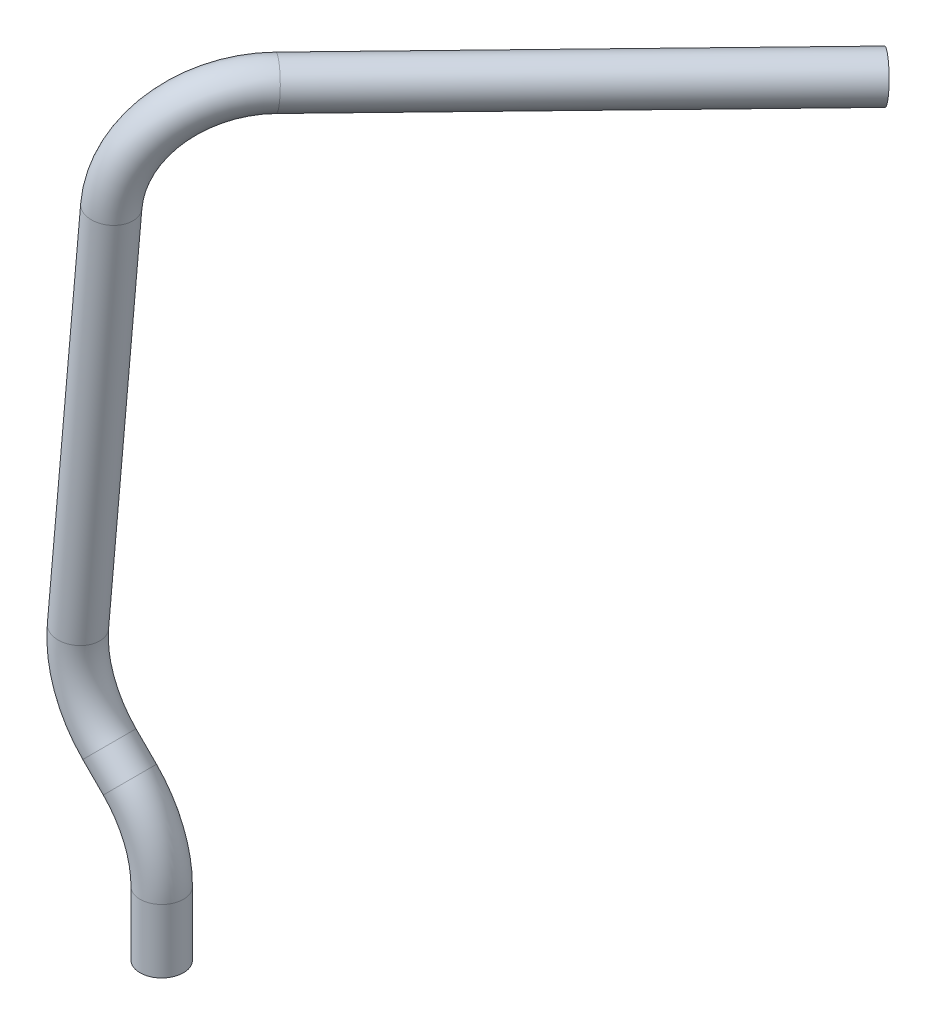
ISO-10303-21;
HEADER;
FILE_DESCRIPTION(('STEP AP214'),'2;1');
FILE_NAME('part.step','',(''),(''),'','','');
FILE_SCHEMA(('AUTOMOTIVE_DESIGN { 1 0 10303 214 1 1 1 1 }'));
ENDSEC;
DATA;
#1=APPLICATION_CONTEXT('core data for automotive mechanical design processes');
#2=APPLICATION_PROTOCOL_DEFINITION('international standard','automotive_design',2000,#1);
#3=PRODUCT_CONTEXT('',#1,'mechanical');
#4=PRODUCT('Part','Part','',(#3));
#5=PRODUCT_RELATED_PRODUCT_CATEGORY('part','',(#4));
#6=PRODUCT_DEFINITION_FORMATION('','',#4);
#7=PRODUCT_DEFINITION_CONTEXT('part definition',#1,'design');
#8=PRODUCT_DEFINITION('design','',#6,#7);
#9=PRODUCT_DEFINITION_SHAPE('','',#8);
#10=(LENGTH_UNIT() NAMED_UNIT(*) SI_UNIT(.MILLI.,.METRE.));
#11=(NAMED_UNIT(*) PLANE_ANGLE_UNIT() SI_UNIT($,.RADIAN.));
#12=(NAMED_UNIT(*) SI_UNIT($,.STERADIAN.) SOLID_ANGLE_UNIT());
#13=UNCERTAINTY_MEASURE_WITH_UNIT(LENGTH_MEASURE(1.E-05),#10,'distance_accuracy_value','');
#14=(GEOMETRIC_REPRESENTATION_CONTEXT(3) GLOBAL_UNCERTAINTY_ASSIGNED_CONTEXT((#13)) GLOBAL_UNIT_ASSIGNED_CONTEXT((#10,
#11,#12)) REPRESENTATION_CONTEXT('',''));
#15=CARTESIAN_POINT('',(0.,0.,0.));
#16=DIRECTION('',(0.,0.,1.));
#17=DIRECTION('',(1.,0.,0.));
#18=AXIS2_PLACEMENT_3D('',#15,#16,#17);
#19=CARTESIAN_POINT('',(5.992077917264,159.960109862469,-19.033076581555));
#20=DIRECTION('',(0.615661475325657,-0.0723791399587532,-0.784679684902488));
#21=DIRECTION('',(-0.786743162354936,0.,-0.617280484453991));
#22=AXIS2_PLACEMENT_3D('',#19,#20,#21);
#23=CYLINDRICAL_SURFACE('',#22,4.7625);
#24=CARTESIAN_POINT('',(5.992077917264,159.960109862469,-19.033076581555));
#25=DIRECTION('',(0.615661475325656,-0.0723791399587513,-0.784679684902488));
#26=DIRECTION('',(0.561849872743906,0.738521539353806,0.37270719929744));
#27=AXIS2_PLACEMENT_3D('',#24,#25,#26);
#28=CIRCLE('',#27,4.7625);
#29=CARTESIAN_POINT('',(6.46132016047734,164.698935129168,-19.1020190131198));
#30=VERTEX_POINT('',#29);
#31=EDGE_CURVE('E60',#30,#30,#28,.T.);
#32=ORIENTED_EDGE('',*,*,#31,.T.);
#33=EDGE_LOOP('',(#32));
#34=FACE_BOUND('',#33,.T.);
#35=CARTESIAN_POINT('',(64.6338334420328,153.065996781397,-93.7738165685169));
#36=DIRECTION('',(0.615661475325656,-0.0723791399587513,-0.784679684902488));
#37=DIRECTION('',(0.561849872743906,0.738521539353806,0.37270719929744));
#38=AXIS2_PLACEMENT_3D('',#35,#36,#37);
#39=CIRCLE('',#38,4.7625);
#40=CARTESIAN_POINT('',(67.3096434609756,156.58320561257,-91.9987985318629));
#41=VERTEX_POINT('',#40);
#42=EDGE_CURVE('E12',#41,#41,#39,.T.);
#43=ORIENTED_EDGE('',*,*,#42,.F.);
#44=EDGE_LOOP('',(#43));
#45=FACE_BOUND('',#44,.T.);
#46=ADVANCED_FACE('F47',(#34,#45),#23,.T.);
#47=CARTESIAN_POINT('',(5.992077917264,159.960109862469,-19.033076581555));
#48=DIRECTION('',(0.615661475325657,-0.0723791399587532,-0.784679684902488));
#49=DIRECTION('',(-0.786743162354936,0.,-0.617280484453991));
#50=AXIS2_PLACEMENT_3D('',#47,#48,#49);
#51=CYLINDRICAL_SURFACE('',#50,3.8735);
#52=CARTESIAN_POINT('',(5.992077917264,159.960109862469,-19.033076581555));
#53=DIRECTION('',(0.615661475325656,-0.0723791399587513,-0.784679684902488));
#54=DIRECTION('',(0.561849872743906,0.738521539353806,0.37270719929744));
#55=AXIS2_PLACEMENT_3D('',#52,#53,#54);
#56=CIRCLE('',#55,3.8735);
#57=CARTESIAN_POINT('',(6.37372827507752,163.814354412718,-19.0891497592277));
#58=VERTEX_POINT('',#57);
#59=EDGE_CURVE('E65',#58,#58,#56,.T.);
#60=ORIENTED_EDGE('',*,*,#59,.F.);
#61=EDGE_LOOP('',(#60));
#62=FACE_BOUND('',#61,.T.);
#63=CARTESIAN_POINT('',(64.6338334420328,153.065996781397,-93.7738165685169));
#64=DIRECTION('',(0.615661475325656,-0.0723791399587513,-0.784679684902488));
#65=DIRECTION('',(0.561849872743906,0.738521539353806,0.37270719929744));
#66=AXIS2_PLACEMENT_3D('',#63,#64,#65);
#67=CIRCLE('',#66,3.8735);
#68=CARTESIAN_POINT('',(66.8101589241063,155.926659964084,-92.3301352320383));
#69=VERTEX_POINT('',#68);
#70=EDGE_CURVE('E54',#69,#69,#67,.T.);
#71=ORIENTED_EDGE('',*,*,#70,.T.);
#72=EDGE_LOOP('',(#71));
#73=FACE_BOUND('',#72,.T.);
#74=ADVANCED_FACE('F157',(#62,#73),#51,.F.);
#75=CARTESIAN_POINT('',(3.64586670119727,136.265983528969,-18.6883644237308));
#76=DIRECTION('',(-0.781826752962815,0.0684009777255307,-0.619732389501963));
#77=DIRECTION('',(-0.621187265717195,0.,0.783662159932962));
#78=AXIS2_PLACEMENT_3D('',#75,#76,#77);
#79=TOROIDAL_SURFACE('',#78,23.8125000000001,4.7625);
#80=CARTESIAN_POINT('',(-11.0553545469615,137.552173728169,0.));
#81=DIRECTION('',(0.0871557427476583,0.996194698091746,0.));
#82=DIRECTION('',(0.,0.,1.));
#83=AXIS2_PLACEMENT_3D('',#80,#81,#82);
#84=CIRCLE('',#83,4.7625);
#85=CARTESIAN_POINT('',(-13.9955987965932,137.809411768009,3.7376728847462));
#86=VERTEX_POINT('',#85);
#87=EDGE_CURVE('E71',#86,#86,#84,.T.);
#88=CARTESIAN_POINT('',(3.64586670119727,136.265983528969,-18.6883644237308));
#89=DIRECTION('',(-0.781826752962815,0.0684009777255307,-0.619732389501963));
#90=DIRECTION('',(-0.621187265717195,0.,0.783662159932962));
#91=AXIS2_PLACEMENT_3D('',#88,#89,#90);
#92=CIRCLE('',#91,28.5750000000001);
#93=EDGE_CURVE('',#86,#30,#92,.T.);
#94=ORIENTED_EDGE('',*,*,#87,.T.);
#95=ORIENTED_EDGE('',*,*,#31,.F.);
#96=ORIENTED_EDGE('',*,*,#93,.T.);
#97=ORIENTED_EDGE('',*,*,#93,.F.);
#98=EDGE_LOOP('',(#94,#96,#95,#97));
#99=FACE_BOUND('',#98,.T.);
#100=ADVANCED_FACE('F153',(#99),#79,.T.);
#101=CARTESIAN_POINT('',(3.64586670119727,136.265983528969,-18.6883644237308));
#102=DIRECTION('',(-0.781826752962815,0.0684009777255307,-0.619732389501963));
#103=DIRECTION('',(-0.621187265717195,0.,0.783662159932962));
#104=AXIS2_PLACEMENT_3D('',#101,#102,#103);
#105=TOROIDAL_SURFACE('',#104,23.8125000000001,3.8735);
#106=CARTESIAN_POINT('',(-11.0553545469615,137.552173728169,0.));
#107=DIRECTION('',(0.0871557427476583,0.996194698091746,0.));
#108=DIRECTION('',(0.,0.,1.));
#109=AXIS2_PLACEMENT_3D('',#106,#107,#108);
#110=CIRCLE('',#109,3.8735);
#111=CARTESIAN_POINT('',(-13.4467532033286,137.761394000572,3.03997394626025));
#112=VERTEX_POINT('',#111);
#113=EDGE_CURVE('E75',#112,#112,#110,.T.);
#114=CARTESIAN_POINT('',(3.64586670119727,136.265983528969,-18.6883644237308));
#115=DIRECTION('',(-0.781826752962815,0.0684009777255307,-0.619732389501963));
#116=DIRECTION('',(-0.621187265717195,0.,0.783662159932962));
#117=AXIS2_PLACEMENT_3D('',#114,#115,#116);
#118=CIRCLE('',#117,27.6860000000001);
#119=EDGE_CURVE('',#112,#58,#118,.T.);
#120=ORIENTED_EDGE('',*,*,#113,.F.);
#121=ORIENTED_EDGE('',*,*,#59,.T.);
#122=ORIENTED_EDGE('',*,*,#119,.T.);
#123=ORIENTED_EDGE('',*,*,#119,.F.);
#124=EDGE_LOOP('',(#120,#122,#121,#123));
#125=FACE_BOUND('',#124,.T.);
#126=ADVANCED_FACE('F150',(#125),#105,.F.);
#127=CARTESIAN_POINT('',(-18.348553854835,54.1905241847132,0.));
#128=DIRECTION('',(0.0871557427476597,0.996194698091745,0.));
#129=DIRECTION('',(-0.996194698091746,0.0871557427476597,0.));
#130=AXIS2_PLACEMENT_3D('',#127,#128,#129);
#131=CYLINDRICAL_SURFACE('',#130,4.7625);
#132=CARTESIAN_POINT('',(-18.348553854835,54.1905241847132,0.));
#133=DIRECTION('',(0.0871557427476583,0.996194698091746,0.));
#134=DIRECTION('',(0.,0.,1.));
#135=AXIS2_PLACEMENT_3D('',#132,#133,#134);
#136=CIRCLE('',#135,4.7625);
#137=CARTESIAN_POINT('',(-23.0929311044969,54.605603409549,0.));
#138=VERTEX_POINT('',#137);
#139=EDGE_CURVE('E79',#138,#138,#136,.T.);
#140=ORIENTED_EDGE('',*,*,#139,.T.);
#141=EDGE_LOOP('',(#140));
#142=FACE_BOUND('',#141,.T.);
#143=ORIENTED_EDGE('',*,*,#87,.F.);
#144=EDGE_LOOP('',(#143));
#145=FACE_BOUND('',#144,.T.);
#146=ADVANCED_FACE('F146',(#142,#145),#131,.T.);
#147=CARTESIAN_POINT('',(-18.348553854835,54.1905241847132,0.));
#148=DIRECTION('',(0.0871557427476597,0.996194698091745,0.));
#149=DIRECTION('',(-0.996194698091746,0.0871557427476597,0.));
#150=AXIS2_PLACEMENT_3D('',#147,#148,#149);
#151=CYLINDRICAL_SURFACE('',#150,3.8735);
#152=CARTESIAN_POINT('',(-18.348553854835,54.1905241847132,0.));
#153=DIRECTION('',(0.0871557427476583,0.996194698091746,0.));
#154=DIRECTION('',(0.,0.,1.));
#155=AXIS2_PLACEMENT_3D('',#152,#153,#154);
#156=CIRCLE('',#155,3.8735);
#157=CARTESIAN_POINT('',(-22.2073140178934,54.5281219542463,0.));
#158=VERTEX_POINT('',#157);
#159=EDGE_CURVE('E82',#158,#158,#156,.T.);
#160=ORIENTED_EDGE('',*,*,#159,.F.);
#161=EDGE_LOOP('',(#160));
#162=FACE_BOUND('',#161,.T.);
#163=ORIENTED_EDGE('',*,*,#113,.T.);
#164=EDGE_LOOP('',(#163));
#165=FACE_BOUND('',#164,.T.);
#166=ADVANCED_FACE('F143',(#162,#165),#151,.F.);
#167=CARTESIAN_POINT('',(5.37333239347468,52.1151280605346,0.));
#168=DIRECTION('',(0.,0.,-1.));
#169=DIRECTION('',(0.,1.,0.));
#170=AXIS2_PLACEMENT_3D('',#167,#168,#169);
#171=TOROIDAL_SURFACE('',#170,23.8125,4.7625);
#172=CARTESIAN_POINT('',(-11.46464783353,35.2771478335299,0.));
#173=DIRECTION('',(-0.707106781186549,0.707106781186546,0.));
#174=DIRECTION('',(0.,0.,1.));
#175=AXIS2_PLACEMENT_3D('',#172,#173,#174);
#176=CIRCLE('',#175,4.7625);
#177=CARTESIAN_POINT('',(-14.8322438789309,31.909551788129,0.));
#178=VERTEX_POINT('',#177);
#179=EDGE_CURVE('E86',#178,#178,#176,.T.);
#180=CARTESIAN_POINT('',(5.37333239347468,52.1151280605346,0.));
#181=DIRECTION('',(0.,0.,-1.));
#182=DIRECTION('',(0.,1.,0.));
#183=AXIS2_PLACEMENT_3D('',#180,#181,#182);
#184=CIRCLE('',#183,28.575);
#185=EDGE_CURVE('',#178,#138,#184,.T.);
#186=ORIENTED_EDGE('',*,*,#179,.T.);
#187=ORIENTED_EDGE('',*,*,#139,.F.);
#188=ORIENTED_EDGE('',*,*,#185,.T.);
#189=ORIENTED_EDGE('',*,*,#185,.F.);
#190=EDGE_LOOP('',(#186,#188,#187,#189));
#191=FACE_BOUND('',#190,.T.);
#192=ADVANCED_FACE('F139',(#191),#171,.T.);
#193=CARTESIAN_POINT('',(5.37333239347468,52.1151280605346,0.));
#194=DIRECTION('',(0.,0.,-1.));
#195=DIRECTION('',(0.,1.,0.));
#196=AXIS2_PLACEMENT_3D('',#193,#194,#195);
#197=TOROIDAL_SURFACE('',#196,23.8125,3.8735);
#198=CARTESIAN_POINT('',(-11.46464783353,35.2771478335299,0.));
#199=DIRECTION('',(-0.707106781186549,0.707106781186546,0.));
#200=DIRECTION('',(0.,0.,1.));
#201=AXIS2_PLACEMENT_3D('',#198,#199,#200);
#202=CIRCLE('',#201,3.8735);
#203=CARTESIAN_POINT('',(-14.203625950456,32.5381697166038,0.));
#204=VERTEX_POINT('',#203);
#205=EDGE_CURVE('E90',#204,#204,#202,.T.);
#206=CARTESIAN_POINT('',(5.37333239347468,52.1151280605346,0.));
#207=DIRECTION('',(0.,0.,-1.));
#208=DIRECTION('',(0.,1.,0.));
#209=AXIS2_PLACEMENT_3D('',#206,#207,#208);
#210=CIRCLE('',#209,27.686);
#211=EDGE_CURVE('',#204,#158,#210,.T.);
#212=ORIENTED_EDGE('',*,*,#205,.F.);
#213=ORIENTED_EDGE('',*,*,#159,.T.);
#214=ORIENTED_EDGE('',*,*,#211,.T.);
#215=ORIENTED_EDGE('',*,*,#211,.F.);
#216=EDGE_LOOP('',(#212,#214,#213,#215));
#217=FACE_BOUND('',#216,.T.);
#218=ADVANCED_FACE('F136',(#217),#197,.F.);
#219=CARTESIAN_POINT('',(-6.97451977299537,30.7870197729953,0.));
#220=DIRECTION('',(-0.707106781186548,0.707106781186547,0.));
#221=DIRECTION('',(-0.707106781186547,-0.707106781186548,0.));
#222=AXIS2_PLACEMENT_3D('',#219,#220,#221);
#223=CYLINDRICAL_SURFACE('',#222,4.7625);
#224=CARTESIAN_POINT('',(-6.97451977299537,30.7870197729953,0.));
#225=DIRECTION('',(-0.707106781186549,0.707106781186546,0.));
#226=DIRECTION('',(0.,0.,1.));
#227=AXIS2_PLACEMENT_3D('',#224,#225,#226);
#228=CIRCLE('',#227,4.7625);
#229=CARTESIAN_POINT('',(-3.60692372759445,34.1546158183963,0.));
#230=VERTEX_POINT('',#229);
#231=EDGE_CURVE('E94',#230,#230,#228,.T.);
#232=ORIENTED_EDGE('',*,*,#231,.T.);
#233=EDGE_LOOP('',(#232));
#234=FACE_BOUND('',#233,.T.);
#235=ORIENTED_EDGE('',*,*,#179,.F.);
#236=EDGE_LOOP('',(#235));
#237=FACE_BOUND('',#236,.T.);
#238=ADVANCED_FACE('F132',(#234,#237),#223,.T.);
#239=CARTESIAN_POINT('',(-6.97451977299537,30.7870197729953,0.));
#240=DIRECTION('',(-0.707106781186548,0.707106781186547,0.));
#241=DIRECTION('',(-0.707106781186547,-0.707106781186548,0.));
#242=AXIS2_PLACEMENT_3D('',#239,#240,#241);
#243=CYLINDRICAL_SURFACE('',#242,3.8735);
#244=CARTESIAN_POINT('',(-6.97451977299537,30.7870197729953,0.));
#245=DIRECTION('',(-0.707106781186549,0.707106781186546,0.));
#246=DIRECTION('',(0.,0.,1.));
#247=AXIS2_PLACEMENT_3D('',#244,#245,#246);
#248=CIRCLE('',#247,3.8735);
#249=CARTESIAN_POINT('',(-4.23554165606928,33.5259978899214,0.));
#250=VERTEX_POINT('',#249);
#251=EDGE_CURVE('E98',#250,#250,#248,.T.);
#252=ORIENTED_EDGE('',*,*,#251,.F.);
#253=EDGE_LOOP('',(#252));
#254=FACE_BOUND('',#253,.T.);
#255=ORIENTED_EDGE('',*,*,#205,.T.);
#256=EDGE_LOOP('',(#255));
#257=FACE_BOUND('',#256,.T.);
#258=ADVANCED_FACE('F129',(#254,#257),#243,.F.);
#259=CARTESIAN_POINT('',(-23.8125,13.9490395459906,0.));
#260=DIRECTION('',(0.,0.,1.));
#261=DIRECTION('',(1.,0.,0.));
#262=AXIS2_PLACEMENT_3D('',#259,#260,#261);
#263=TOROIDAL_SURFACE('',#262,23.8125,4.7625);
#264=CARTESIAN_POINT('',(0.,13.9490395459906,0.));
#265=DIRECTION('',(0.,1.,0.));
#266=DIRECTION('',(0.,0.,1.));
#267=AXIS2_PLACEMENT_3D('',#264,#265,#266);
#268=CIRCLE('',#267,4.7625);
#269=CARTESIAN_POINT('',(4.7625,13.9490395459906,0.));
#270=VERTEX_POINT('',#269);
#271=EDGE_CURVE('E102',#270,#270,#268,.T.);
#272=CARTESIAN_POINT('',(-23.8125,13.9490395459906,0.));
#273=DIRECTION('',(0.,0.,1.));
#274=DIRECTION('',(1.,0.,0.));
#275=AXIS2_PLACEMENT_3D('',#272,#273,#274);
#276=CIRCLE('',#275,28.575);
#277=EDGE_CURVE('',#270,#230,#276,.T.);
#278=ORIENTED_EDGE('',*,*,#271,.T.);
#279=ORIENTED_EDGE('',*,*,#231,.F.);
#280=ORIENTED_EDGE('',*,*,#277,.T.);
#281=ORIENTED_EDGE('',*,*,#277,.F.);
#282=EDGE_LOOP('',(#278,#280,#279,#281));
#283=FACE_BOUND('',#282,.T.);
#284=ADVANCED_FACE('F125',(#283),#263,.T.);
#285=CARTESIAN_POINT('',(-23.8125,13.9490395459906,0.));
#286=DIRECTION('',(0.,0.,1.));
#287=DIRECTION('',(1.,0.,0.));
#288=AXIS2_PLACEMENT_3D('',#285,#286,#287);
#289=TOROIDAL_SURFACE('',#288,23.8125,3.8735);
#290=CARTESIAN_POINT('',(0.,13.9490395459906,0.));
#291=DIRECTION('',(0.,1.,0.));
#292=DIRECTION('',(0.,0.,1.));
#293=AXIS2_PLACEMENT_3D('',#290,#291,#292);
#294=CIRCLE('',#293,3.8735);
#295=CARTESIAN_POINT('',(3.8735,13.9490395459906,0.));
#296=VERTEX_POINT('',#295);
#297=EDGE_CURVE('E107',#296,#296,#294,.T.);
#298=CARTESIAN_POINT('',(-23.8125,13.9490395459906,0.));
#299=DIRECTION('',(0.,0.,1.));
#300=DIRECTION('',(1.,0.,0.));
#301=AXIS2_PLACEMENT_3D('',#298,#299,#300);
#302=CIRCLE('',#301,27.686);
#303=EDGE_CURVE('',#296,#250,#302,.T.);
#304=ORIENTED_EDGE('',*,*,#297,.F.);
#305=ORIENTED_EDGE('',*,*,#251,.T.);
#306=ORIENTED_EDGE('',*,*,#303,.T.);
#307=ORIENTED_EDGE('',*,*,#303,.F.);
#308=EDGE_LOOP('',(#304,#306,#305,#307));
#309=FACE_BOUND('',#308,.T.);
#310=ADVANCED_FACE('F122',(#309),#289,.F.);
#311=CARTESIAN_POINT('',(0.,13.9490395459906,0.));
#312=DIRECTION('',(0.,-1.,0.));
#313=DIRECTION('',(0.,0.,-1.));
#314=AXIS2_PLACEMENT_3D('',#311,#312,#313);
#315=CYLINDRICAL_SURFACE('',#314,3.8735);
#316=ORIENTED_EDGE('',*,*,#297,.T.);
#317=EDGE_LOOP('',(#316));
#318=FACE_BOUND('',#317,.T.);
#319=CARTESIAN_POINT('',(0.,0.,0.));
#320=DIRECTION('',(0.,1.,0.));
#321=DIRECTION('',(0.,0.,1.));
#322=AXIS2_PLACEMENT_3D('',#319,#320,#321);
#323=CIRCLE('',#322,3.8735);
#324=CARTESIAN_POINT('',(0.,0.,3.8735));
#325=VERTEX_POINT('',#324);
#326=EDGE_CURVE('E108',#325,#325,#323,.T.);
#327=ORIENTED_EDGE('',*,*,#326,.F.);
#328=EDGE_LOOP('',(#327));
#329=FACE_BOUND('',#328,.T.);
#330=ADVANCED_FACE('F119',(#318,#329),#315,.F.);
#331=CARTESIAN_POINT('',(0.,13.9490395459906,0.));
#332=DIRECTION('',(0.,-1.,0.));
#333=DIRECTION('',(0.,0.,-1.));
#334=AXIS2_PLACEMENT_3D('',#331,#332,#333);
#335=CYLINDRICAL_SURFACE('',#334,4.7625);
#336=ORIENTED_EDGE('',*,*,#271,.F.);
#337=EDGE_LOOP('',(#336));
#338=FACE_BOUND('',#337,.T.);
#339=CARTESIAN_POINT('',(0.,0.,0.));
#340=DIRECTION('',(0.,1.,0.));
#341=DIRECTION('',(0.,0.,1.));
#342=AXIS2_PLACEMENT_3D('',#339,#340,#341);
#343=CIRCLE('',#342,4.7625);
#344=CARTESIAN_POINT('',(0.,0.,4.7625));
#345=VERTEX_POINT('',#344);
#346=EDGE_CURVE('E103',#345,#345,#343,.T.);
#347=ORIENTED_EDGE('',*,*,#346,.T.);
#348=EDGE_LOOP('',(#347));
#349=FACE_BOUND('',#348,.T.);
#350=ADVANCED_FACE('F181',(#338,#349),#335,.T.);
#351=CARTESIAN_POINT('',(64.6338334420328,153.065996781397,-93.7738165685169));
#352=DIRECTION('',(0.615661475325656,-0.0723791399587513,-0.784679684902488));
#353=DIRECTION('',(0.561849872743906,0.738521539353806,0.37270719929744));
#354=AXIS2_PLACEMENT_3D('',#351,#352,#353);
#355=PLANE('',#354);
#356=ORIENTED_EDGE('',*,*,#70,.F.);
#357=EDGE_LOOP('',(#356));
#358=FACE_BOUND('',#357,.T.);
#359=ORIENTED_EDGE('',*,*,#42,.T.);
#360=EDGE_LOOP('',(#359));
#361=FACE_BOUND('',#360,.T.);
#362=ADVANCED_FACE('F184',(#358,#361),#355,.T.);
#363=CARTESIAN_POINT('',(0.,0.,0.));
#364=DIRECTION('',(0.,1.,0.));
#365=DIRECTION('',(0.,0.,1.));
#366=AXIS2_PLACEMENT_3D('',#363,#364,#365);
#367=PLANE('',#366);
#368=ORIENTED_EDGE('',*,*,#326,.T.);
#369=EDGE_LOOP('',(#368));
#370=FACE_BOUND('',#369,.T.);
#371=ORIENTED_EDGE('',*,*,#346,.F.);
#372=EDGE_LOOP('',(#371));
#373=FACE_BOUND('',#372,.T.);
#374=ADVANCED_FACE('F186',(#370,#373),#367,.F.);
#375=CLOSED_SHELL('',(#46,#74,#100,#126,#146,#166,#192,#218,#238,#258,#284,#310,#330,#350,#362,#374));
#376=MANIFOLD_SOLID_BREP('B2',#375);
#377=ADVANCED_BREP_SHAPE_REPRESENTATION('',(#18,#376),#14);
#378=SHAPE_DEFINITION_REPRESENTATION(#9,#377);
ENDSEC;
END-ISO-10303-21;
